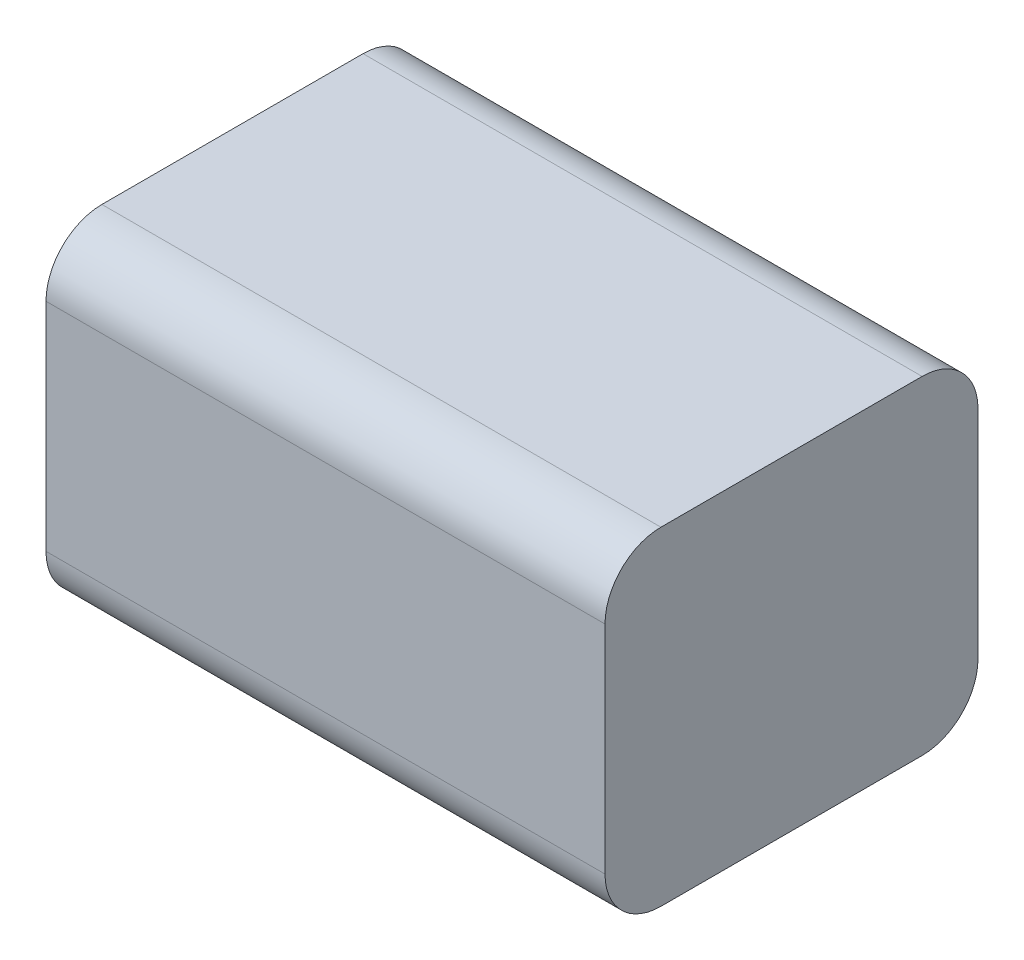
ISO-10303-21;
HEADER;
FILE_DESCRIPTION(('STEP AP214'),'2;1');
FILE_NAME('part.step','',(''),(''),'','','');
FILE_SCHEMA(('AUTOMOTIVE_DESIGN { 1 0 10303 214 1 1 1 1 }'));
ENDSEC;
DATA;
#1=APPLICATION_CONTEXT('core data for automotive mechanical design processes');
#2=APPLICATION_PROTOCOL_DEFINITION('international standard','automotive_design',2000,#1);
#3=PRODUCT_CONTEXT('',#1,'mechanical');
#4=PRODUCT('Part','Part','',(#3));
#5=PRODUCT_RELATED_PRODUCT_CATEGORY('part','',(#4));
#6=PRODUCT_DEFINITION_FORMATION('','',#4);
#7=PRODUCT_DEFINITION_CONTEXT('part definition',#1,'design');
#8=PRODUCT_DEFINITION('design','',#6,#7);
#9=PRODUCT_DEFINITION_SHAPE('','',#8);
#10=(LENGTH_UNIT() NAMED_UNIT(*) SI_UNIT(.MILLI.,.METRE.));
#11=(NAMED_UNIT(*) PLANE_ANGLE_UNIT() SI_UNIT($,.RADIAN.));
#12=(NAMED_UNIT(*) SI_UNIT($,.STERADIAN.) SOLID_ANGLE_UNIT());
#13=UNCERTAINTY_MEASURE_WITH_UNIT(LENGTH_MEASURE(1.E-05),#10,'distance_accuracy_value','');
#14=(GEOMETRIC_REPRESENTATION_CONTEXT(3) GLOBAL_UNCERTAINTY_ASSIGNED_CONTEXT((#13)) GLOBAL_UNIT_ASSIGNED_CONTEXT((#10,
#11,#12)) REPRESENTATION_CONTEXT('',''));
#15=CARTESIAN_POINT('',(0.,0.,0.));
#16=DIRECTION('',(0.,0.,1.));
#17=DIRECTION('',(1.,0.,0.));
#18=AXIS2_PLACEMENT_3D('',#15,#16,#17);
#19=CARTESIAN_POINT('',(42.5,-10.2795,-11.676));
#20=DIRECTION('',(0.,0.,1.));
#21=DIRECTION('',(1.,0.,0.));
#22=AXIS2_PLACEMENT_3D('',#19,#20,#21);
#23=PLANE('',#22);
#24=DIRECTION('',(0.,1.,0.));
#25=VECTOR('',#24,1.);
#26=CARTESIAN_POINT('',(42.5,-10.2795,-11.676));
#27=LINE('',#26,#25);
#28=CARTESIAN_POINT('',(42.5,-6.7795,-11.676));
#29=VERTEX_POINT('',#28);
#30=CARTESIAN_POINT('',(42.5,6.7795,-11.676));
#31=VERTEX_POINT('',#30);
#32=EDGE_CURVE('E138',#29,#31,#27,.T.);
#33=ORIENTED_EDGE('',*,*,#32,.F.);
#34=DIRECTION('',(-1.,0.,0.));
#35=VECTOR('',#34,1.);
#36=CARTESIAN_POINT('',(42.5,-6.7795,-11.676));
#37=LINE('',#36,#35);
#38=CARTESIAN_POINT('',(7.5,-6.7795,-11.676));
#39=VERTEX_POINT('',#38);
#40=EDGE_CURVE('E164',#29,#39,#37,.T.);
#41=ORIENTED_EDGE('',*,*,#40,.T.);
#42=DIRECTION('',(0.,1.,0.));
#43=VECTOR('',#42,1.);
#44=CARTESIAN_POINT('',(7.5,-10.2795,-11.676));
#45=LINE('',#44,#43);
#46=CARTESIAN_POINT('',(7.5,6.7795,-11.676));
#47=VERTEX_POINT('',#46);
#48=EDGE_CURVE('E172',#39,#47,#45,.T.);
#49=ORIENTED_EDGE('',*,*,#48,.T.);
#50=DIRECTION('',(-1.,0.,0.));
#51=VECTOR('',#50,1.);
#52=CARTESIAN_POINT('',(42.5,6.7795,-11.676));
#53=LINE('',#52,#51);
#54=EDGE_CURVE('E162',#47,#31,#53,.F.);
#55=ORIENTED_EDGE('',*,*,#54,.T.);
#56=EDGE_LOOP('',(#33,#41,#49,#55));
#57=FACE_BOUND('',#56,.T.);
#58=ADVANCED_FACE('F47',(#57),#23,.F.);
#59=CARTESIAN_POINT('',(42.5,10.2795,11.676));
#60=DIRECTION('',(0.,-1.,0.));
#61=DIRECTION('',(0.,0.,-1.));
#62=AXIS2_PLACEMENT_3D('',#59,#60,#61);
#63=PLANE('',#62);
#64=DIRECTION('',(0.,0.,1.));
#65=VECTOR('',#64,1.);
#66=CARTESIAN_POINT('',(7.5,10.2795,11.676));
#67=LINE('',#66,#65);
#68=CARTESIAN_POINT('',(7.5,10.2795,-8.176));
#69=VERTEX_POINT('',#68);
#70=CARTESIAN_POINT('',(7.5,10.2795,8.176));
#71=VERTEX_POINT('',#70);
#72=EDGE_CURVE('E143',#69,#71,#67,.T.);
#73=ORIENTED_EDGE('',*,*,#72,.T.);
#74=DIRECTION('',(-1.,0.,0.));
#75=VECTOR('',#74,1.);
#76=CARTESIAN_POINT('',(42.5,10.2795,8.176));
#77=LINE('',#76,#75);
#78=CARTESIAN_POINT('',(42.5,10.2795,8.176));
#79=VERTEX_POINT('',#78);
#80=EDGE_CURVE('E12',#71,#79,#77,.F.);
#81=ORIENTED_EDGE('',*,*,#80,.T.);
#82=DIRECTION('',(0.,0.,1.));
#83=VECTOR('',#82,1.);
#84=CARTESIAN_POINT('',(42.5,10.2795,11.676));
#85=LINE('',#84,#83);
#86=CARTESIAN_POINT('',(42.5,10.2795,-8.176));
#87=VERTEX_POINT('',#86);
#88=EDGE_CURVE('E141',#87,#79,#85,.T.);
#89=ORIENTED_EDGE('',*,*,#88,.F.);
#90=DIRECTION('',(-1.,0.,0.));
#91=VECTOR('',#90,1.);
#92=CARTESIAN_POINT('',(42.5,10.2795,-8.176));
#93=LINE('',#92,#91);
#94=EDGE_CURVE('E55',#87,#69,#93,.T.);
#95=ORIENTED_EDGE('',*,*,#94,.T.);
#96=EDGE_LOOP('',(#73,#81,#89,#95));
#97=FACE_BOUND('',#96,.T.);
#98=ADVANCED_FACE('F169',(#97),#63,.F.);
#99=CARTESIAN_POINT('',(42.5,-10.2795,11.676));
#100=DIRECTION('',(0.,0.,-1.));
#101=DIRECTION('',(-1.,0.,0.));
#102=AXIS2_PLACEMENT_3D('',#99,#100,#101);
#103=PLANE('',#102);
#104=DIRECTION('',(0.,-1.,0.));
#105=VECTOR('',#104,1.);
#106=CARTESIAN_POINT('',(7.5,-10.2795,11.676));
#107=LINE('',#106,#105);
#108=CARTESIAN_POINT('',(7.5,6.7795,11.676));
#109=VERTEX_POINT('',#108);
#110=CARTESIAN_POINT('',(7.5,-6.7795,11.676));
#111=VERTEX_POINT('',#110);
#112=EDGE_CURVE('E139',#109,#111,#107,.T.);
#113=ORIENTED_EDGE('',*,*,#112,.T.);
#114=DIRECTION('',(-1.,0.,0.));
#115=VECTOR('',#114,1.);
#116=CARTESIAN_POINT('',(42.5,-6.7795,11.676));
#117=LINE('',#116,#115);
#118=CARTESIAN_POINT('',(42.5,-6.7795,11.676));
#119=VERTEX_POINT('',#118);
#120=EDGE_CURVE('E117',#111,#119,#117,.F.);
#121=ORIENTED_EDGE('',*,*,#120,.T.);
#122=DIRECTION('',(0.,-1.,0.));
#123=VECTOR('',#122,1.);
#124=CARTESIAN_POINT('',(42.5,-10.2795,11.676));
#125=LINE('',#124,#123);
#126=CARTESIAN_POINT('',(42.5,6.7795,11.676));
#127=VERTEX_POINT('',#126);
#128=EDGE_CURVE('E176',#127,#119,#125,.T.);
#129=ORIENTED_EDGE('',*,*,#128,.F.);
#130=DIRECTION('',(-1.,0.,0.));
#131=VECTOR('',#130,1.);
#132=CARTESIAN_POINT('',(42.5,6.7795,11.676));
#133=LINE('',#132,#131);
#134=EDGE_CURVE('E122',#127,#109,#133,.T.);
#135=ORIENTED_EDGE('',*,*,#134,.T.);
#136=EDGE_LOOP('',(#113,#121,#129,#135));
#137=FACE_BOUND('',#136,.T.);
#138=ADVANCED_FACE('F186',(#137),#103,.F.);
#139=CARTESIAN_POINT('',(42.5,-10.2795,11.676));
#140=DIRECTION('',(0.,1.,0.));
#141=DIRECTION('',(0.,0.,1.));
#142=AXIS2_PLACEMENT_3D('',#139,#140,#141);
#143=PLANE('',#142);
#144=DIRECTION('',(0.,0.,-1.));
#145=VECTOR('',#144,1.);
#146=CARTESIAN_POINT('',(42.5,-10.2795,11.676));
#147=LINE('',#146,#145);
#148=CARTESIAN_POINT('',(42.5,-10.2795,8.176));
#149=VERTEX_POINT('',#148);
#150=CARTESIAN_POINT('',(42.5,-10.2795,-8.176));
#151=VERTEX_POINT('',#150);
#152=EDGE_CURVE('E132',#149,#151,#147,.T.);
#153=ORIENTED_EDGE('',*,*,#152,.F.);
#154=DIRECTION('',(-1.,0.,0.));
#155=VECTOR('',#154,1.);
#156=CARTESIAN_POINT('',(42.5,-10.2795,8.176));
#157=LINE('',#156,#155);
#158=CARTESIAN_POINT('',(7.5,-10.2795,8.176));
#159=VERTEX_POINT('',#158);
#160=EDGE_CURVE('E116',#149,#159,#157,.T.);
#161=ORIENTED_EDGE('',*,*,#160,.T.);
#162=DIRECTION('',(0.,0.,-1.));
#163=VECTOR('',#162,1.);
#164=CARTESIAN_POINT('',(7.5,-10.2795,11.676));
#165=LINE('',#164,#163);
#166=CARTESIAN_POINT('',(7.5,-10.2795,-8.176));
#167=VERTEX_POINT('',#166);
#168=EDGE_CURVE('E129',#159,#167,#165,.T.);
#169=ORIENTED_EDGE('',*,*,#168,.T.);
#170=DIRECTION('',(-1.,0.,0.));
#171=VECTOR('',#170,1.);
#172=CARTESIAN_POINT('',(42.5,-10.2795,-8.176));
#173=LINE('',#172,#171);
#174=EDGE_CURVE('E134',#167,#151,#173,.F.);
#175=ORIENTED_EDGE('',*,*,#174,.T.);
#176=EDGE_LOOP('',(#153,#161,#169,#175));
#177=FACE_BOUND('',#176,.T.);
#178=ADVANCED_FACE('F128',(#177),#143,.F.);
#179=CARTESIAN_POINT('',(42.5,0.,0.));
#180=DIRECTION('',(-1.,0.,0.));
#181=DIRECTION('',(0.,0.,1.));
#182=AXIS2_PLACEMENT_3D('',#179,#180,#181);
#183=PLANE('',#182);
#184=ORIENTED_EDGE('',*,*,#128,.T.);
#185=CARTESIAN_POINT('',(42.5,-6.7795,8.176));
#186=DIRECTION('',(-1.,0.,0.));
#187=DIRECTION('',(0.,0.,1.));
#188=AXIS2_PLACEMENT_3D('',#185,#186,#187);
#189=CIRCLE('',#188,3.5);
#190=EDGE_CURVE('E160',#119,#149,#189,.F.);
#191=ORIENTED_EDGE('',*,*,#190,.T.);
#192=ORIENTED_EDGE('',*,*,#152,.T.);
#193=CARTESIAN_POINT('',(42.5,-6.7795,-8.176));
#194=DIRECTION('',(-1.,0.,0.));
#195=DIRECTION('',(0.,0.,1.));
#196=AXIS2_PLACEMENT_3D('',#193,#194,#195);
#197=CIRCLE('',#196,3.5);
#198=EDGE_CURVE('E158',#151,#29,#197,.F.);
#199=ORIENTED_EDGE('',*,*,#198,.T.);
#200=ORIENTED_EDGE('',*,*,#32,.T.);
#201=CARTESIAN_POINT('',(42.5,6.7795,-8.176));
#202=DIRECTION('',(-1.,0.,0.));
#203=DIRECTION('',(0.,0.,1.));
#204=AXIS2_PLACEMENT_3D('',#201,#202,#203);
#205=CIRCLE('',#204,3.5);
#206=EDGE_CURVE('E67',#31,#87,#205,.F.);
#207=ORIENTED_EDGE('',*,*,#206,.T.);
#208=ORIENTED_EDGE('',*,*,#88,.T.);
#209=CARTESIAN_POINT('',(42.5,6.7795,8.176));
#210=DIRECTION('',(-1.,0.,0.));
#211=DIRECTION('',(0.,0.,1.));
#212=AXIS2_PLACEMENT_3D('',#209,#210,#211);
#213=CIRCLE('',#212,3.5);
#214=EDGE_CURVE('E156',#79,#127,#213,.F.);
#215=ORIENTED_EDGE('',*,*,#214,.T.);
#216=EDGE_LOOP('',(#184,#191,#192,#199,#200,#207,#208,#215));
#217=FACE_BOUND('',#216,.T.);
#218=ADVANCED_FACE('F180',(#217),#183,.F.);
#219=CARTESIAN_POINT('',(7.5,0.,0.));
#220=DIRECTION('',(-1.,0.,0.));
#221=DIRECTION('',(0.,0.,1.));
#222=AXIS2_PLACEMENT_3D('',#219,#220,#221);
#223=PLANE('',#222);
#224=ORIENTED_EDGE('',*,*,#168,.F.);
#225=CARTESIAN_POINT('',(7.5,-6.7795,8.176));
#226=DIRECTION('',(-1.,0.,0.));
#227=DIRECTION('',(0.,0.,1.));
#228=AXIS2_PLACEMENT_3D('',#225,#226,#227);
#229=CIRCLE('',#228,3.5);
#230=EDGE_CURVE('E112',#159,#111,#229,.T.);
#231=ORIENTED_EDGE('',*,*,#230,.T.);
#232=ORIENTED_EDGE('',*,*,#112,.F.);
#233=CARTESIAN_POINT('',(7.5,6.7795,8.176));
#234=DIRECTION('',(-1.,0.,0.));
#235=DIRECTION('',(0.,0.,1.));
#236=AXIS2_PLACEMENT_3D('',#233,#234,#235);
#237=CIRCLE('',#236,3.5);
#238=EDGE_CURVE('E149',#109,#71,#237,.T.);
#239=ORIENTED_EDGE('',*,*,#238,.T.);
#240=ORIENTED_EDGE('',*,*,#72,.F.);
#241=CARTESIAN_POINT('',(7.5,6.7795,-8.176));
#242=DIRECTION('',(-1.,0.,0.));
#243=DIRECTION('',(0.,0.,1.));
#244=AXIS2_PLACEMENT_3D('',#241,#242,#243);
#245=CIRCLE('',#244,3.5);
#246=EDGE_CURVE('E133',#69,#47,#245,.T.);
#247=ORIENTED_EDGE('',*,*,#246,.T.);
#248=ORIENTED_EDGE('',*,*,#48,.F.);
#249=CARTESIAN_POINT('',(7.5,-6.7795,-8.176));
#250=DIRECTION('',(-1.,0.,0.));
#251=DIRECTION('',(0.,0.,1.));
#252=AXIS2_PLACEMENT_3D('',#249,#250,#251);
#253=CIRCLE('',#252,3.5);
#254=EDGE_CURVE('E123',#39,#167,#253,.T.);
#255=ORIENTED_EDGE('',*,*,#254,.T.);
#256=EDGE_LOOP('',(#224,#231,#232,#239,#240,#247,#248,#255));
#257=FACE_BOUND('',#256,.T.);
#258=ADVANCED_FACE('F136',(#257),#223,.T.);
#259=CARTESIAN_POINT('',(42.5,-6.7795,8.176));
#260=DIRECTION('',(-1.,0.,0.));
#261=DIRECTION('',(0.,0.,1.));
#262=AXIS2_PLACEMENT_3D('',#259,#260,#261);
#263=CYLINDRICAL_SURFACE('',#262,3.5);
#264=ORIENTED_EDGE('',*,*,#190,.F.);
#265=ORIENTED_EDGE('',*,*,#120,.F.);
#266=ORIENTED_EDGE('',*,*,#230,.F.);
#267=ORIENTED_EDGE('',*,*,#160,.F.);
#268=EDGE_LOOP('',(#264,#265,#266,#267));
#269=FACE_BOUND('',#268,.T.);
#270=ADVANCED_FACE('F115',(#269),#263,.T.);
#271=CARTESIAN_POINT('',(42.5,-6.7795,-8.176));
#272=DIRECTION('',(-1.,0.,0.));
#273=DIRECTION('',(0.,0.,1.));
#274=AXIS2_PLACEMENT_3D('',#271,#272,#273);
#275=CYLINDRICAL_SURFACE('',#274,3.5);
#276=ORIENTED_EDGE('',*,*,#198,.F.);
#277=ORIENTED_EDGE('',*,*,#174,.F.);
#278=ORIENTED_EDGE('',*,*,#254,.F.);
#279=ORIENTED_EDGE('',*,*,#40,.F.);
#280=EDGE_LOOP('',(#276,#277,#278,#279));
#281=FACE_BOUND('',#280,.T.);
#282=ADVANCED_FACE('F191',(#281),#275,.T.);
#283=CARTESIAN_POINT('',(42.5,6.7795,8.176));
#284=DIRECTION('',(-1.,0.,0.));
#285=DIRECTION('',(0.,0.,1.));
#286=AXIS2_PLACEMENT_3D('',#283,#284,#285);
#287=CYLINDRICAL_SURFACE('',#286,3.5);
#288=ORIENTED_EDGE('',*,*,#214,.F.);
#289=ORIENTED_EDGE('',*,*,#80,.F.);
#290=ORIENTED_EDGE('',*,*,#238,.F.);
#291=ORIENTED_EDGE('',*,*,#134,.F.);
#292=EDGE_LOOP('',(#288,#289,#290,#291));
#293=FACE_BOUND('',#292,.T.);
#294=ADVANCED_FACE('F184',(#293),#287,.T.);
#295=CARTESIAN_POINT('',(42.5,6.7795,-8.176));
#296=DIRECTION('',(-1.,0.,0.));
#297=DIRECTION('',(0.,0.,1.));
#298=AXIS2_PLACEMENT_3D('',#295,#296,#297);
#299=CYLINDRICAL_SURFACE('',#298,3.5);
#300=ORIENTED_EDGE('',*,*,#206,.F.);
#301=ORIENTED_EDGE('',*,*,#54,.F.);
#302=ORIENTED_EDGE('',*,*,#246,.F.);
#303=ORIENTED_EDGE('',*,*,#94,.F.);
#304=EDGE_LOOP('',(#300,#301,#302,#303));
#305=FACE_BOUND('',#304,.T.);
#306=ADVANCED_FACE('F49',(#305),#299,.T.);
#307=CLOSED_SHELL('',(#58,#98,#138,#178,#218,#258,#270,#282,#294,#306));
#308=MANIFOLD_SOLID_BREP('B2',#307);
#309=ADVANCED_BREP_SHAPE_REPRESENTATION('',(#18,#308),#14);
#310=SHAPE_DEFINITION_REPRESENTATION(#9,#309);
ENDSEC;
END-ISO-10303-21;
